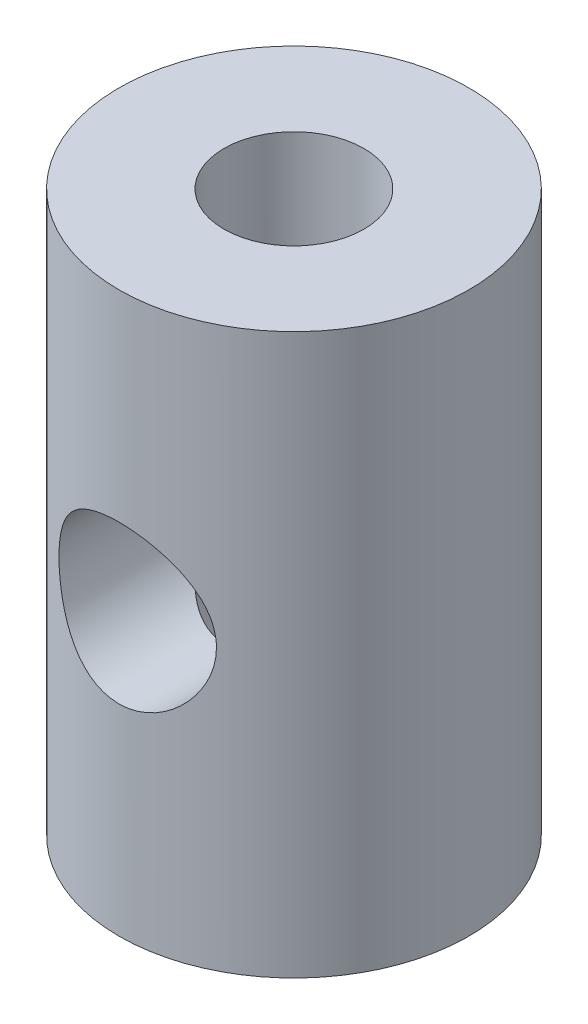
from build123d import *

# Parameters (mm, degrees)
SKETCH1_R          = 5
SKETCH1_R_2        = 2
EXTRUDE2_DEPTH     = 16
SKETCH2_R          = 2.25
CUT_EXTRUDE1_DEPTH = 8


with BuildPart() as part:
    # Sketch1 → Extrude2 (new body)
    with BuildSketch(Plane(origin=(0, 0, 0), x_dir=(1, 0, 0), z_dir=(0, 1, 0))):
        with Locations(Location((0, 0, 0), (0, 0, 270))):
            Circle(SKETCH1_R)
        with Locations(Location((0, 0, 0), (0, 0, 270))):
            Circle(SKETCH1_R_2, mode=Mode.SUBTRACT)
    extrude(amount=EXTRUDE2_DEPTH)

    # Sketch2 → Cut-Extrude1 (cut, symmetric)
    with BuildSketch(Plane.XY):
        with Locations(Location((0, 8, 0), (0, 0, 89.999999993))):
            Circle(SKETCH2_R)
    extrude(amount=CUT_EXTRUDE1_DEPTH, both=True, mode=Mode.SUBTRACT)


solid = part.part
